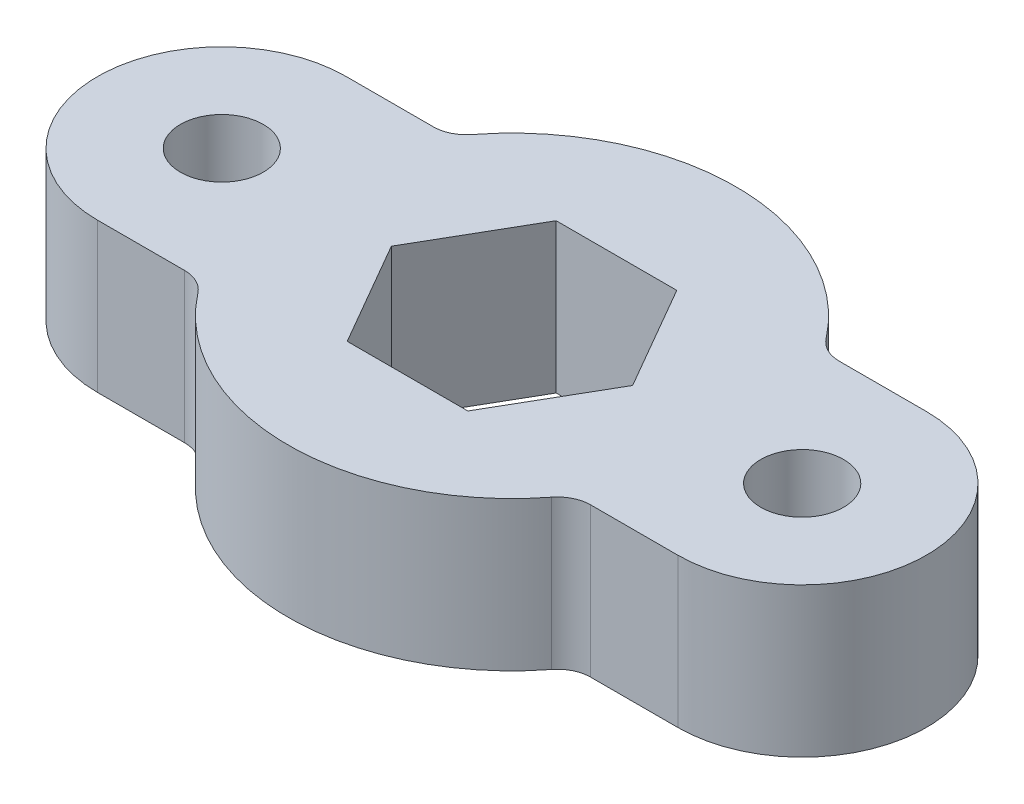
ISO-10303-21;
HEADER;
FILE_DESCRIPTION(('STEP AP214'),'2;1');
FILE_NAME('part.step','',(''),(''),'','','');
FILE_SCHEMA(('AUTOMOTIVE_DESIGN { 1 0 10303 214 1 1 1 1 }'));
ENDSEC;
DATA;
#1=APPLICATION_CONTEXT('core data for automotive mechanical design processes');
#2=APPLICATION_PROTOCOL_DEFINITION('international standard','automotive_design',2000,#1);
#3=PRODUCT_CONTEXT('',#1,'mechanical');
#4=PRODUCT('Part','Part','',(#3));
#5=PRODUCT_RELATED_PRODUCT_CATEGORY('part','',(#4));
#6=PRODUCT_DEFINITION_FORMATION('','',#4);
#7=PRODUCT_DEFINITION_CONTEXT('part definition',#1,'design');
#8=PRODUCT_DEFINITION('design','',#6,#7);
#9=PRODUCT_DEFINITION_SHAPE('','',#8);
#10=(LENGTH_UNIT() NAMED_UNIT(*) SI_UNIT(.MILLI.,.METRE.));
#11=(NAMED_UNIT(*) PLANE_ANGLE_UNIT() SI_UNIT($,.RADIAN.));
#12=(NAMED_UNIT(*) SI_UNIT($,.STERADIAN.) SOLID_ANGLE_UNIT());
#13=UNCERTAINTY_MEASURE_WITH_UNIT(LENGTH_MEASURE(1.E-05),#10,'distance_accuracy_value','');
#14=(GEOMETRIC_REPRESENTATION_CONTEXT(3) GLOBAL_UNCERTAINTY_ASSIGNED_CONTEXT((#13)) GLOBAL_UNIT_ASSIGNED_CONTEXT((#10,
#11,#12)) REPRESENTATION_CONTEXT('',''));
#15=CARTESIAN_POINT('',(0.,0.,0.));
#16=DIRECTION('',(0.,0.,1.));
#17=DIRECTION('',(1.,0.,0.));
#18=AXIS2_PLACEMENT_3D('',#15,#16,#17);
#19=CARTESIAN_POINT('',(-17.5,9.,0.));
#20=DIRECTION('',(0.,1.,0.));
#21=DIRECTION('',(0.,0.,1.));
#22=AXIS2_PLACEMENT_3D('',#19,#20,#21);
#23=PLANE('',#22);
#24=CARTESIAN_POINT('',(-17.5,9.,0.));
#25=DIRECTION('',(0.,1.,0.));
#26=DIRECTION('',(0.,0.,1.));
#27=AXIS2_PLACEMENT_3D('',#24,#25,#26);
#28=CIRCLE('',#27,2.5);
#29=CARTESIAN_POINT('',(-17.5,9.,2.5));
#30=VERTEX_POINT('',#29);
#31=EDGE_CURVE('E195',#30,#30,#28,.T.);
#32=ORIENTED_EDGE('',*,*,#31,.F.);
#33=EDGE_LOOP('',(#32));
#34=FACE_BOUND('',#33,.T.);
#35=CARTESIAN_POINT('',(-17.5,9.,0.));
#36=DIRECTION('',(0.,1.,0.));
#37=DIRECTION('',(0.,0.,1.));
#38=AXIS2_PLACEMENT_3D('',#35,#36,#37);
#39=CIRCLE('',#38,7.5);
#40=CARTESIAN_POINT('',(-17.5,9.,-7.5));
#41=VERTEX_POINT('',#40);
#42=CARTESIAN_POINT('',(-17.5,9.,7.5));
#43=VERTEX_POINT('',#42);
#44=EDGE_CURVE('E216',#41,#43,#39,.T.);
#45=ORIENTED_EDGE('',*,*,#44,.T.);
#46=DIRECTION('',(1.,0.,0.));
#47=VECTOR('',#46,1.);
#48=CARTESIAN_POINT('',(-17.5,9.,7.5));
#49=LINE('',#48,#47);
#50=CARTESIAN_POINT('',(-12.2474487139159,9.,7.5));
#51=VERTEX_POINT('',#50);
#52=EDGE_CURVE('E219',#43,#51,#49,.T.);
#53=ORIENTED_EDGE('',*,*,#52,.T.);
#54=CARTESIAN_POINT('',(-12.2474487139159,9.,9.5));
#55=DIRECTION('',(0.,1.,0.));
#56=DIRECTION('',(0.,0.,1.));
#57=AXIS2_PLACEMENT_3D('',#54,#55,#56);
#58=CIRCLE('',#57,2.);
#59=CARTESIAN_POINT('',(-10.66713275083,9.,8.2741935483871));
#60=VERTEX_POINT('',#59);
#61=EDGE_CURVE('E11',#51,#60,#58,.F.);
#62=ORIENTED_EDGE('',*,*,#61,.T.);
#63=CARTESIAN_POINT('',(0.,9.,0.));
#64=DIRECTION('',(0.,1.,0.));
#65=DIRECTION('',(0.,0.,1.));
#66=AXIS2_PLACEMENT_3D('',#63,#64,#65);
#67=CIRCLE('',#66,13.5);
#68=CARTESIAN_POINT('',(10.66713275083,9.,8.2741935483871));
#69=VERTEX_POINT('',#68);
#70=EDGE_CURVE('E222',#60,#69,#67,.T.);
#71=ORIENTED_EDGE('',*,*,#70,.T.);
#72=CARTESIAN_POINT('',(12.2474487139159,9.,9.5));
#73=DIRECTION('',(0.,1.,0.));
#74=DIRECTION('',(0.,0.,1.));
#75=AXIS2_PLACEMENT_3D('',#72,#73,#74);
#76=CIRCLE('',#75,2.);
#77=CARTESIAN_POINT('',(12.2474487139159,9.,7.5));
#78=VERTEX_POINT('',#77);
#79=EDGE_CURVE('E296',#69,#78,#76,.F.);
#80=ORIENTED_EDGE('',*,*,#79,.T.);
#81=DIRECTION('',(1.,0.,0.));
#82=VECTOR('',#81,1.);
#83=CARTESIAN_POINT('',(17.5,9.,7.49999999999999));
#84=LINE('',#83,#82);
#85=CARTESIAN_POINT('',(17.5,9.,7.49999999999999));
#86=VERTEX_POINT('',#85);
#87=EDGE_CURVE('E225',#78,#86,#84,.T.);
#88=ORIENTED_EDGE('',*,*,#87,.T.);
#89=CARTESIAN_POINT('',(17.5,9.,0.));
#90=DIRECTION('',(0.,1.,0.));
#91=DIRECTION('',(0.,0.,1.));
#92=AXIS2_PLACEMENT_3D('',#89,#90,#91);
#93=CIRCLE('',#92,7.5);
#94=CARTESIAN_POINT('',(17.5,9.,-7.50000000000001));
#95=VERTEX_POINT('',#94);
#96=EDGE_CURVE('E227',#86,#95,#93,.T.);
#97=ORIENTED_EDGE('',*,*,#96,.T.);
#98=DIRECTION('',(-1.,0.,0.));
#99=VECTOR('',#98,1.);
#100=CARTESIAN_POINT('',(17.5,9.,-7.50000000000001));
#101=LINE('',#100,#99);
#102=CARTESIAN_POINT('',(12.2474487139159,9.,-7.5));
#103=VERTEX_POINT('',#102);
#104=EDGE_CURVE('E229',#95,#103,#101,.T.);
#105=ORIENTED_EDGE('',*,*,#104,.T.);
#106=CARTESIAN_POINT('',(12.2474487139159,9.,-9.5));
#107=DIRECTION('',(0.,1.,0.));
#108=DIRECTION('',(0.,0.,1.));
#109=AXIS2_PLACEMENT_3D('',#106,#107,#108);
#110=CIRCLE('',#109,2.);
#111=CARTESIAN_POINT('',(10.66713275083,9.,-8.2741935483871));
#112=VERTEX_POINT('',#111);
#113=EDGE_CURVE('E292',#103,#112,#110,.F.);
#114=ORIENTED_EDGE('',*,*,#113,.T.);
#115=CARTESIAN_POINT('',(0.,9.,0.));
#116=DIRECTION('',(0.,1.,0.));
#117=DIRECTION('',(0.,0.,1.));
#118=AXIS2_PLACEMENT_3D('',#115,#116,#117);
#119=CIRCLE('',#118,13.5);
#120=CARTESIAN_POINT('',(-10.66713275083,9.,-8.2741935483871));
#121=VERTEX_POINT('',#120);
#122=EDGE_CURVE('E232',#112,#121,#119,.T.);
#123=ORIENTED_EDGE('',*,*,#122,.T.);
#124=CARTESIAN_POINT('',(-12.2474487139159,9.,-9.5));
#125=DIRECTION('',(0.,1.,0.));
#126=DIRECTION('',(0.,0.,1.));
#127=AXIS2_PLACEMENT_3D('',#124,#125,#126);
#128=CIRCLE('',#127,2.);
#129=CARTESIAN_POINT('',(-12.2474487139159,9.,-7.5));
#130=VERTEX_POINT('',#129);
#131=EDGE_CURVE('E288',#121,#130,#128,.F.);
#132=ORIENTED_EDGE('',*,*,#131,.T.);
#133=DIRECTION('',(-1.,0.,0.));
#134=VECTOR('',#133,1.);
#135=CARTESIAN_POINT('',(-17.5,9.,-7.5));
#136=LINE('',#135,#134);
#137=EDGE_CURVE('E235',#130,#41,#136,.T.);
#138=ORIENTED_EDGE('',*,*,#137,.T.);
#139=EDGE_LOOP('',(#45,#53,#62,#71,#80,#88,#97,#105,#114,#123,#132,#138));
#140=FACE_BOUND('',#139,.T.);
#141=DIRECTION('',(-1.,0.,0.));
#142=VECTOR('',#141,1.);
#143=CARTESIAN_POINT('',(3.63730669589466,9.,-6.29999999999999));
#144=LINE('',#143,#142);
#145=CARTESIAN_POINT('',(3.63730669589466,9.,-6.29999999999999));
#146=VERTEX_POINT('',#145);
#147=CARTESIAN_POINT('',(-3.63730669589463,9.,-6.29999999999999));
#148=VERTEX_POINT('',#147);
#149=EDGE_CURVE('E167',#146,#148,#144,.T.);
#150=ORIENTED_EDGE('',*,*,#149,.F.);
#151=DIRECTION('',(-0.5,0.,-0.866025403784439));
#152=VECTOR('',#151,1.);
#153=CARTESIAN_POINT('',(7.2746133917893,9.,0.));
#154=LINE('',#153,#152);
#155=CARTESIAN_POINT('',(7.2746133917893,9.,0.));
#156=VERTEX_POINT('',#155);
#157=EDGE_CURVE('E157',#156,#146,#154,.T.);
#158=ORIENTED_EDGE('',*,*,#157,.F.);
#159=DIRECTION('',(0.5,0.,-0.866025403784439));
#160=VECTOR('',#159,1.);
#161=CARTESIAN_POINT('',(3.63730669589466,9.,6.30000000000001));
#162=LINE('',#161,#160);
#163=CARTESIAN_POINT('',(3.63730669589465,9.,6.30000000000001));
#164=VERTEX_POINT('',#163);
#165=EDGE_CURVE('E191',#164,#156,#162,.T.);
#166=ORIENTED_EDGE('',*,*,#165,.F.);
#167=DIRECTION('',(1.,0.,0.));
#168=VECTOR('',#167,1.);
#169=CARTESIAN_POINT('',(-3.63730669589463,9.,6.30000000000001));
#170=LINE('',#169,#168);
#171=CARTESIAN_POINT('',(-3.63730669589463,9.,6.30000000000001));
#172=VERTEX_POINT('',#171);
#173=EDGE_CURVE('E188',#172,#164,#170,.T.);
#174=ORIENTED_EDGE('',*,*,#173,.F.);
#175=DIRECTION('',(0.5,0.,0.866025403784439));
#176=VECTOR('',#175,1.);
#177=CARTESIAN_POINT('',(-7.27461339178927,9.,0.));
#178=LINE('',#177,#176);
#179=CARTESIAN_POINT('',(-7.27461339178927,9.,0.));
#180=VERTEX_POINT('',#179);
#181=EDGE_CURVE('E183',#180,#172,#178,.T.);
#182=ORIENTED_EDGE('',*,*,#181,.F.);
#183=DIRECTION('',(-0.5,0.,0.866025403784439));
#184=VECTOR('',#183,1.);
#185=CARTESIAN_POINT('',(-3.63730669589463,9.,-6.29999999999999));
#186=LINE('',#185,#184);
#187=EDGE_CURVE('E181',#148,#180,#186,.T.);
#188=ORIENTED_EDGE('',*,*,#187,.F.);
#189=EDGE_LOOP('',(#150,#158,#166,#174,#182,#188));
#190=FACE_BOUND('',#189,.T.);
#191=CARTESIAN_POINT('',(17.5,9.,0.));
#192=DIRECTION('',(0.,1.,0.));
#193=DIRECTION('',(0.,0.,1.));
#194=AXIS2_PLACEMENT_3D('',#191,#192,#193);
#195=CIRCLE('',#194,2.5);
#196=CARTESIAN_POINT('',(17.5,9.,2.49999999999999));
#197=VERTEX_POINT('',#196);
#198=EDGE_CURVE('E541',#197,#197,#195,.T.);
#199=ORIENTED_EDGE('',*,*,#198,.F.);
#200=EDGE_LOOP('',(#199));
#201=FACE_BOUND('',#200,.T.);
#202=ADVANCED_FACE('F33',(#34,#140,#190,#201),#23,.T.);
#203=CARTESIAN_POINT('',(-17.5,0.,0.));
#204=DIRECTION('',(0.,1.,0.));
#205=DIRECTION('',(0.,0.,1.));
#206=AXIS2_PLACEMENT_3D('',#203,#204,#205);
#207=PLANE('',#206);
#208=CARTESIAN_POINT('',(-17.5,0.,0.));
#209=DIRECTION('',(0.,1.,0.));
#210=DIRECTION('',(0.,0.,1.));
#211=AXIS2_PLACEMENT_3D('',#208,#209,#210);
#212=CIRCLE('',#211,7.5);
#213=CARTESIAN_POINT('',(-17.5,0.,-7.5));
#214=VERTEX_POINT('',#213);
#215=CARTESIAN_POINT('',(-17.5,0.,7.5));
#216=VERTEX_POINT('',#215);
#217=EDGE_CURVE('E175',#214,#216,#212,.T.);
#218=ORIENTED_EDGE('',*,*,#217,.F.);
#219=DIRECTION('',(-1.,0.,0.));
#220=VECTOR('',#219,1.);
#221=CARTESIAN_POINT('',(-17.5,0.,-7.5));
#222=LINE('',#221,#220);
#223=CARTESIAN_POINT('',(-12.2474487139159,0.,-7.5));
#224=VERTEX_POINT('',#223);
#225=EDGE_CURVE('E220',#224,#214,#222,.T.);
#226=ORIENTED_EDGE('',*,*,#225,.F.);
#227=CARTESIAN_POINT('',(-12.2474487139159,0.,-9.5));
#228=DIRECTION('',(0.,1.,0.));
#229=DIRECTION('',(0.,0.,1.));
#230=AXIS2_PLACEMENT_3D('',#227,#228,#229);
#231=CIRCLE('',#230,2.);
#232=CARTESIAN_POINT('',(-10.66713275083,0.,-8.2741935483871));
#233=VERTEX_POINT('',#232);
#234=EDGE_CURVE('E286',#224,#233,#231,.T.);
#235=ORIENTED_EDGE('',*,*,#234,.T.);
#236=CARTESIAN_POINT('',(0.,0.,0.));
#237=DIRECTION('',(0.,1.,0.));
#238=DIRECTION('',(0.,0.,1.));
#239=AXIS2_PLACEMENT_3D('',#236,#237,#238);
#240=CIRCLE('',#239,13.5);
#241=CARTESIAN_POINT('',(10.66713275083,0.,-8.2741935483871));
#242=VERTEX_POINT('',#241);
#243=EDGE_CURVE('E252',#242,#233,#240,.T.);
#244=ORIENTED_EDGE('',*,*,#243,.F.);
#245=CARTESIAN_POINT('',(12.2474487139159,0.,-9.5));
#246=DIRECTION('',(0.,1.,0.));
#247=DIRECTION('',(0.,0.,1.));
#248=AXIS2_PLACEMENT_3D('',#245,#246,#247);
#249=CIRCLE('',#248,2.);
#250=CARTESIAN_POINT('',(12.2474487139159,0.,-7.5));
#251=VERTEX_POINT('',#250);
#252=EDGE_CURVE('E290',#242,#251,#249,.T.);
#253=ORIENTED_EDGE('',*,*,#252,.T.);
#254=DIRECTION('',(-1.,0.,0.));
#255=VECTOR('',#254,1.);
#256=CARTESIAN_POINT('',(17.5,0.,-7.50000000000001));
#257=LINE('',#256,#255);
#258=CARTESIAN_POINT('',(17.5,0.,-7.50000000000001));
#259=VERTEX_POINT('',#258);
#260=EDGE_CURVE('E249',#259,#251,#257,.T.);
#261=ORIENTED_EDGE('',*,*,#260,.F.);
#262=CARTESIAN_POINT('',(17.5,0.,0.));
#263=DIRECTION('',(0.,1.,0.));
#264=DIRECTION('',(0.,0.,1.));
#265=AXIS2_PLACEMENT_3D('',#262,#263,#264);
#266=CIRCLE('',#265,7.5);
#267=CARTESIAN_POINT('',(17.5,0.,7.49999999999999));
#268=VERTEX_POINT('',#267);
#269=EDGE_CURVE('E247',#268,#259,#266,.T.);
#270=ORIENTED_EDGE('',*,*,#269,.F.);
#271=DIRECTION('',(1.,0.,0.));
#272=VECTOR('',#271,1.);
#273=CARTESIAN_POINT('',(17.5,0.,7.49999999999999));
#274=LINE('',#273,#272);
#275=CARTESIAN_POINT('',(12.2474487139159,0.,7.5));
#276=VERTEX_POINT('',#275);
#277=EDGE_CURVE('E245',#276,#268,#274,.T.);
#278=ORIENTED_EDGE('',*,*,#277,.F.);
#279=CARTESIAN_POINT('',(12.2474487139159,0.,9.5));
#280=DIRECTION('',(0.,1.,0.));
#281=DIRECTION('',(0.,0.,1.));
#282=AXIS2_PLACEMENT_3D('',#279,#280,#281);
#283=CIRCLE('',#282,2.);
#284=CARTESIAN_POINT('',(10.66713275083,0.,8.2741935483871));
#285=VERTEX_POINT('',#284);
#286=EDGE_CURVE('E294',#276,#285,#283,.T.);
#287=ORIENTED_EDGE('',*,*,#286,.T.);
#288=CARTESIAN_POINT('',(0.,0.,0.));
#289=DIRECTION('',(0.,1.,0.));
#290=DIRECTION('',(0.,0.,1.));
#291=AXIS2_PLACEMENT_3D('',#288,#289,#290);
#292=CIRCLE('',#291,13.5);
#293=CARTESIAN_POINT('',(-10.66713275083,0.,8.2741935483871));
#294=VERTEX_POINT('',#293);
#295=EDGE_CURVE('E242',#294,#285,#292,.T.);
#296=ORIENTED_EDGE('',*,*,#295,.F.);
#297=CARTESIAN_POINT('',(-12.2474487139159,0.,9.5));
#298=DIRECTION('',(0.,1.,0.));
#299=DIRECTION('',(0.,0.,1.));
#300=AXIS2_PLACEMENT_3D('',#297,#298,#299);
#301=CIRCLE('',#300,2.);
#302=CARTESIAN_POINT('',(-12.2474487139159,0.,7.5));
#303=VERTEX_POINT('',#302);
#304=EDGE_CURVE('E41',#294,#303,#301,.T.);
#305=ORIENTED_EDGE('',*,*,#304,.T.);
#306=DIRECTION('',(1.,0.,0.));
#307=VECTOR('',#306,1.);
#308=CARTESIAN_POINT('',(-17.5,0.,7.5));
#309=LINE('',#308,#307);
#310=EDGE_CURVE('E240',#216,#303,#309,.T.);
#311=ORIENTED_EDGE('',*,*,#310,.F.);
#312=EDGE_LOOP('',(#218,#226,#235,#244,#253,#261,#270,#278,#287,#296,#305,#311));
#313=FACE_BOUND('',#312,.T.);
#314=DIRECTION('',(-0.5,0.,-0.866025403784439));
#315=VECTOR('',#314,1.);
#316=CARTESIAN_POINT('',(7.2746133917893,0.,0.));
#317=LINE('',#316,#315);
#318=CARTESIAN_POINT('',(7.27461339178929,0.,0.));
#319=VERTEX_POINT('',#318);
#320=CARTESIAN_POINT('',(3.63730669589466,0.,-6.29999999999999));
#321=VERTEX_POINT('',#320);
#322=EDGE_CURVE('E193',#319,#321,#317,.T.);
#323=ORIENTED_EDGE('',*,*,#322,.T.);
#324=DIRECTION('',(-1.,0.,0.));
#325=VECTOR('',#324,1.);
#326=CARTESIAN_POINT('',(3.63730669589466,0.,-6.29999999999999));
#327=LINE('',#326,#325);
#328=CARTESIAN_POINT('',(-3.63730669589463,0.,-6.29999999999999));
#329=VERTEX_POINT('',#328);
#330=EDGE_CURVE('E174',#321,#329,#327,.T.);
#331=ORIENTED_EDGE('',*,*,#330,.T.);
#332=DIRECTION('',(-0.5,0.,0.866025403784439));
#333=VECTOR('',#332,1.);
#334=CARTESIAN_POINT('',(-3.63730669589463,0.,-6.29999999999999));
#335=LINE('',#334,#333);
#336=CARTESIAN_POINT('',(-7.27461339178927,0.,0.));
#337=VERTEX_POINT('',#336);
#338=EDGE_CURVE('E197',#329,#337,#335,.T.);
#339=ORIENTED_EDGE('',*,*,#338,.T.);
#340=DIRECTION('',(0.5,0.,0.866025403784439));
#341=VECTOR('',#340,1.);
#342=CARTESIAN_POINT('',(-7.27461339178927,0.,0.));
#343=LINE('',#342,#341);
#344=CARTESIAN_POINT('',(-3.63730669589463,0.,6.30000000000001));
#345=VERTEX_POINT('',#344);
#346=EDGE_CURVE('E200',#337,#345,#343,.T.);
#347=ORIENTED_EDGE('',*,*,#346,.T.);
#348=DIRECTION('',(1.,0.,0.));
#349=VECTOR('',#348,1.);
#350=CARTESIAN_POINT('',(-3.63730669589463,0.,6.30000000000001));
#351=LINE('',#350,#349);
#352=CARTESIAN_POINT('',(3.63730669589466,0.,6.30000000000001));
#353=VERTEX_POINT('',#352);
#354=EDGE_CURVE('E203',#345,#353,#351,.T.);
#355=ORIENTED_EDGE('',*,*,#354,.T.);
#356=DIRECTION('',(0.5,0.,-0.866025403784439));
#357=VECTOR('',#356,1.);
#358=CARTESIAN_POINT('',(3.63730669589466,0.,6.30000000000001));
#359=LINE('',#358,#357);
#360=EDGE_CURVE('E168',#353,#319,#359,.T.);
#361=ORIENTED_EDGE('',*,*,#360,.T.);
#362=EDGE_LOOP('',(#323,#331,#339,#347,#355,#361));
#363=FACE_BOUND('',#362,.T.);
#364=CARTESIAN_POINT('',(-17.5,0.,0.));
#365=DIRECTION('',(0.,1.,0.));
#366=DIRECTION('',(0.,0.,1.));
#367=AXIS2_PLACEMENT_3D('',#364,#365,#366);
#368=CIRCLE('',#367,2.5);
#369=CARTESIAN_POINT('',(-17.5,0.,2.5));
#370=VERTEX_POINT('',#369);
#371=EDGE_CURVE('E547',#370,#370,#368,.T.);
#372=ORIENTED_EDGE('',*,*,#371,.T.);
#373=EDGE_LOOP('',(#372));
#374=FACE_BOUND('',#373,.T.);
#375=CARTESIAN_POINT('',(17.5,0.,0.));
#376=DIRECTION('',(0.,1.,0.));
#377=DIRECTION('',(0.,0.,1.));
#378=AXIS2_PLACEMENT_3D('',#375,#376,#377);
#379=CIRCLE('',#378,2.5);
#380=CARTESIAN_POINT('',(17.5,0.,2.49999999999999));
#381=VERTEX_POINT('',#380);
#382=EDGE_CURVE('E544',#381,#381,#379,.T.);
#383=ORIENTED_EDGE('',*,*,#382,.T.);
#384=EDGE_LOOP('',(#383));
#385=FACE_BOUND('',#384,.T.);
#386=ADVANCED_FACE('F311',(#313,#363,#374,#385),#207,.F.);
#387=CARTESIAN_POINT('',(-17.5,9.,0.));
#388=DIRECTION('',(0.,-1.,0.));
#389=DIRECTION('',(0.,0.,-1.));
#390=AXIS2_PLACEMENT_3D('',#387,#388,#389);
#391=CYLINDRICAL_SURFACE('',#390,7.5);
#392=ORIENTED_EDGE('',*,*,#217,.T.);
#393=DIRECTION('',(0.,-1.,0.));
#394=VECTOR('',#393,1.);
#395=CARTESIAN_POINT('',(-17.5,9.,7.5));
#396=LINE('',#395,#394);
#397=EDGE_CURVE('E264',#43,#216,#396,.T.);
#398=ORIENTED_EDGE('',*,*,#397,.F.);
#399=ORIENTED_EDGE('',*,*,#44,.F.);
#400=DIRECTION('',(0.,-1.,0.));
#401=VECTOR('',#400,1.);
#402=CARTESIAN_POINT('',(-17.5,9.,-7.5));
#403=LINE('',#402,#401);
#404=EDGE_CURVE('E237',#41,#214,#403,.T.);
#405=ORIENTED_EDGE('',*,*,#404,.T.);
#406=EDGE_LOOP('',(#392,#398,#399,#405));
#407=FACE_BOUND('',#406,.T.);
#408=ADVANCED_FACE('F323',(#407),#391,.T.);
#409=CARTESIAN_POINT('',(-17.5,9.,7.5));
#410=DIRECTION('',(0.,0.,-1.));
#411=DIRECTION('',(-1.,0.,0.));
#412=AXIS2_PLACEMENT_3D('',#409,#410,#411);
#413=PLANE('',#412);
#414=ORIENTED_EDGE('',*,*,#310,.T.);
#415=DIRECTION('',(0.,1.,0.));
#416=VECTOR('',#415,1.);
#417=CARTESIAN_POINT('',(-12.2474487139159,9.,7.5));
#418=LINE('',#417,#416);
#419=EDGE_CURVE('E48',#303,#51,#418,.T.);
#420=ORIENTED_EDGE('',*,*,#419,.T.);
#421=ORIENTED_EDGE('',*,*,#52,.F.);
#422=ORIENTED_EDGE('',*,*,#397,.T.);
#423=EDGE_LOOP('',(#414,#420,#421,#422));
#424=FACE_BOUND('',#423,.T.);
#425=ADVANCED_FACE('F321',(#424),#413,.F.);
#426=CARTESIAN_POINT('',(0.,9.,0.));
#427=DIRECTION('',(0.,-1.,0.));
#428=DIRECTION('',(0.,0.,-1.));
#429=AXIS2_PLACEMENT_3D('',#426,#427,#428);
#430=CYLINDRICAL_SURFACE('',#429,13.5);
#431=ORIENTED_EDGE('',*,*,#295,.T.);
#432=DIRECTION('',(0.,-1.,0.));
#433=VECTOR('',#432,1.);
#434=CARTESIAN_POINT('',(10.66713275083,9.,8.2741935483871));
#435=LINE('',#434,#433);
#436=EDGE_CURVE('E283',#285,#69,#435,.F.);
#437=ORIENTED_EDGE('',*,*,#436,.T.);
#438=ORIENTED_EDGE('',*,*,#70,.F.);
#439=DIRECTION('',(0.,-1.,0.));
#440=VECTOR('',#439,1.);
#441=CARTESIAN_POINT('',(-10.66713275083,9.,8.2741935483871));
#442=LINE('',#441,#440);
#443=EDGE_CURVE('E280',#60,#294,#442,.T.);
#444=ORIENTED_EDGE('',*,*,#443,.T.);
#445=EDGE_LOOP('',(#431,#437,#438,#444));
#446=FACE_BOUND('',#445,.T.);
#447=ADVANCED_FACE('F315',(#446),#430,.T.);
#448=CARTESIAN_POINT('',(17.5,9.,7.49999999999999));
#449=DIRECTION('',(0.,0.,-1.));
#450=DIRECTION('',(-1.,0.,0.));
#451=AXIS2_PLACEMENT_3D('',#448,#449,#450);
#452=PLANE('',#451);
#453=ORIENTED_EDGE('',*,*,#87,.F.);
#454=DIRECTION('',(0.,1.,0.));
#455=VECTOR('',#454,1.);
#456=CARTESIAN_POINT('',(12.2474487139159,0.,7.5));
#457=LINE('',#456,#455);
#458=EDGE_CURVE('E277',#78,#276,#457,.F.);
#459=ORIENTED_EDGE('',*,*,#458,.T.);
#460=ORIENTED_EDGE('',*,*,#277,.T.);
#461=DIRECTION('',(0.,-1.,0.));
#462=VECTOR('',#461,1.);
#463=CARTESIAN_POINT('',(17.5,9.,7.49999999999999));
#464=LINE('',#463,#462);
#465=EDGE_CURVE('E261',#86,#268,#464,.T.);
#466=ORIENTED_EDGE('',*,*,#465,.F.);
#467=EDGE_LOOP('',(#453,#459,#460,#466));
#468=FACE_BOUND('',#467,.T.);
#469=ADVANCED_FACE('F306',(#468),#452,.F.);
#470=CARTESIAN_POINT('',(17.5,9.,0.));
#471=DIRECTION('',(0.,-1.,0.));
#472=DIRECTION('',(0.,0.,-1.));
#473=AXIS2_PLACEMENT_3D('',#470,#471,#472);
#474=CYLINDRICAL_SURFACE('',#473,7.5);
#475=ORIENTED_EDGE('',*,*,#269,.T.);
#476=DIRECTION('',(0.,-1.,0.));
#477=VECTOR('',#476,1.);
#478=CARTESIAN_POINT('',(17.5,9.,-7.50000000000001));
#479=LINE('',#478,#477);
#480=EDGE_CURVE('E258',#95,#259,#479,.T.);
#481=ORIENTED_EDGE('',*,*,#480,.F.);
#482=ORIENTED_EDGE('',*,*,#96,.F.);
#483=ORIENTED_EDGE('',*,*,#465,.T.);
#484=EDGE_LOOP('',(#475,#481,#482,#483));
#485=FACE_BOUND('',#484,.T.);
#486=ADVANCED_FACE('F349',(#485),#474,.T.);
#487=CARTESIAN_POINT('',(17.5,9.,-7.50000000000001));
#488=DIRECTION('',(0.,0.,1.));
#489=DIRECTION('',(1.,0.,0.));
#490=AXIS2_PLACEMENT_3D('',#487,#488,#489);
#491=PLANE('',#490);
#492=ORIENTED_EDGE('',*,*,#260,.T.);
#493=DIRECTION('',(0.,1.,0.));
#494=VECTOR('',#493,1.);
#495=CARTESIAN_POINT('',(12.2474487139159,9.,-7.5));
#496=LINE('',#495,#494);
#497=EDGE_CURVE('E275',#251,#103,#496,.T.);
#498=ORIENTED_EDGE('',*,*,#497,.T.);
#499=ORIENTED_EDGE('',*,*,#104,.F.);
#500=ORIENTED_EDGE('',*,*,#480,.T.);
#501=EDGE_LOOP('',(#492,#498,#499,#500));
#502=FACE_BOUND('',#501,.T.);
#503=ADVANCED_FACE('F346',(#502),#491,.F.);
#504=CARTESIAN_POINT('',(0.,9.,0.));
#505=DIRECTION('',(0.,-1.,0.));
#506=DIRECTION('',(0.,0.,-1.));
#507=AXIS2_PLACEMENT_3D('',#504,#505,#506);
#508=CYLINDRICAL_SURFACE('',#507,13.5);
#509=ORIENTED_EDGE('',*,*,#243,.T.);
#510=DIRECTION('',(0.,-1.,0.));
#511=VECTOR('',#510,1.);
#512=CARTESIAN_POINT('',(-10.66713275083,9.,-8.2741935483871));
#513=LINE('',#512,#511);
#514=EDGE_CURVE('E273',#233,#121,#513,.F.);
#515=ORIENTED_EDGE('',*,*,#514,.T.);
#516=ORIENTED_EDGE('',*,*,#122,.F.);
#517=DIRECTION('',(0.,-1.,0.));
#518=VECTOR('',#517,1.);
#519=CARTESIAN_POINT('',(10.66713275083,9.,-8.2741935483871));
#520=LINE('',#519,#518);
#521=EDGE_CURVE('E270',#112,#242,#520,.T.);
#522=ORIENTED_EDGE('',*,*,#521,.T.);
#523=EDGE_LOOP('',(#509,#515,#516,#522));
#524=FACE_BOUND('',#523,.T.);
#525=ADVANCED_FACE('F337',(#524),#508,.T.);
#526=CARTESIAN_POINT('',(-17.5,9.,-7.5));
#527=DIRECTION('',(0.,0.,1.));
#528=DIRECTION('',(1.,0.,0.));
#529=AXIS2_PLACEMENT_3D('',#526,#527,#528);
#530=PLANE('',#529);
#531=ORIENTED_EDGE('',*,*,#137,.F.);
#532=DIRECTION('',(0.,1.,0.));
#533=VECTOR('',#532,1.);
#534=CARTESIAN_POINT('',(-12.2474487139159,0.,-7.5));
#535=LINE('',#534,#533);
#536=EDGE_CURVE('E267',#130,#224,#535,.F.);
#537=ORIENTED_EDGE('',*,*,#536,.T.);
#538=ORIENTED_EDGE('',*,*,#225,.T.);
#539=ORIENTED_EDGE('',*,*,#404,.F.);
#540=EDGE_LOOP('',(#531,#537,#538,#539));
#541=FACE_BOUND('',#540,.T.);
#542=ADVANCED_FACE('F329',(#541),#530,.F.);
#543=CARTESIAN_POINT('',(7.2746133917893,9.,0.));
#544=DIRECTION('',(-0.866025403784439,0.,0.5));
#545=DIRECTION('',(0.5,0.,0.866025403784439));
#546=AXIS2_PLACEMENT_3D('',#543,#544,#545);
#547=PLANE('',#546);
#548=ORIENTED_EDGE('',*,*,#322,.F.);
#549=DIRECTION('',(0.,-1.,0.));
#550=VECTOR('',#549,1.);
#551=CARTESIAN_POINT('',(7.2746133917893,9.,0.));
#552=LINE('',#551,#550);
#553=EDGE_CURVE('E163',#156,#319,#552,.T.);
#554=ORIENTED_EDGE('',*,*,#553,.F.);
#555=ORIENTED_EDGE('',*,*,#157,.T.);
#556=DIRECTION('',(0.,-1.,0.));
#557=VECTOR('',#556,1.);
#558=CARTESIAN_POINT('',(3.63730669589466,9.,-6.29999999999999));
#559=LINE('',#558,#557);
#560=EDGE_CURVE('E160',#146,#321,#559,.T.);
#561=ORIENTED_EDGE('',*,*,#560,.T.);
#562=EDGE_LOOP('',(#548,#554,#555,#561));
#563=FACE_BOUND('',#562,.T.);
#564=ADVANCED_FACE('F159',(#563),#547,.T.);
#565=CARTESIAN_POINT('',(3.63730669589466,9.,-6.29999999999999));
#566=DIRECTION('',(0.,0.,1.));
#567=DIRECTION('',(1.,0.,0.));
#568=AXIS2_PLACEMENT_3D('',#565,#566,#567);
#569=PLANE('',#568);
#570=ORIENTED_EDGE('',*,*,#330,.F.);
#571=ORIENTED_EDGE('',*,*,#560,.F.);
#572=ORIENTED_EDGE('',*,*,#149,.T.);
#573=DIRECTION('',(0.,-1.,0.));
#574=VECTOR('',#573,1.);
#575=CARTESIAN_POINT('',(-3.63730669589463,9.,-6.29999999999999));
#576=LINE('',#575,#574);
#577=EDGE_CURVE('E176',#148,#329,#576,.T.);
#578=ORIENTED_EDGE('',*,*,#577,.T.);
#579=EDGE_LOOP('',(#570,#571,#572,#578));
#580=FACE_BOUND('',#579,.T.);
#581=ADVANCED_FACE('F171',(#580),#569,.T.);
#582=CARTESIAN_POINT('',(-3.63730669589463,9.,-6.29999999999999));
#583=DIRECTION('',(0.866025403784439,0.,0.5));
#584=DIRECTION('',(0.5,0.,-0.866025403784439));
#585=AXIS2_PLACEMENT_3D('',#582,#583,#584);
#586=PLANE('',#585);
#587=ORIENTED_EDGE('',*,*,#338,.F.);
#588=ORIENTED_EDGE('',*,*,#577,.F.);
#589=ORIENTED_EDGE('',*,*,#187,.T.);
#590=DIRECTION('',(0.,-1.,0.));
#591=VECTOR('',#590,1.);
#592=CARTESIAN_POINT('',(-7.27461339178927,9.,0.));
#593=LINE('',#592,#591);
#594=EDGE_CURVE('E213',#180,#337,#593,.T.);
#595=ORIENTED_EDGE('',*,*,#594,.T.);
#596=EDGE_LOOP('',(#587,#588,#589,#595));
#597=FACE_BOUND('',#596,.T.);
#598=ADVANCED_FACE('F392',(#597),#586,.T.);
#599=CARTESIAN_POINT('',(-7.27461339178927,9.,0.));
#600=DIRECTION('',(0.866025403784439,0.,-0.5));
#601=DIRECTION('',(-0.5,0.,-0.866025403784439));
#602=AXIS2_PLACEMENT_3D('',#599,#600,#601);
#603=PLANE('',#602);
#604=ORIENTED_EDGE('',*,*,#346,.F.);
#605=ORIENTED_EDGE('',*,*,#594,.F.);
#606=ORIENTED_EDGE('',*,*,#181,.T.);
#607=DIRECTION('',(0.,-1.,0.));
#608=VECTOR('',#607,1.);
#609=CARTESIAN_POINT('',(-3.63730669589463,9.,6.30000000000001));
#610=LINE('',#609,#608);
#611=EDGE_CURVE('E211',#172,#345,#610,.T.);
#612=ORIENTED_EDGE('',*,*,#611,.T.);
#613=EDGE_LOOP('',(#604,#605,#606,#612));
#614=FACE_BOUND('',#613,.T.);
#615=ADVANCED_FACE('F398',(#614),#603,.T.);
#616=CARTESIAN_POINT('',(-3.63730669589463,9.,6.30000000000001));
#617=DIRECTION('',(0.,0.,-1.));
#618=DIRECTION('',(-1.,0.,0.));
#619=AXIS2_PLACEMENT_3D('',#616,#617,#618);
#620=PLANE('',#619);
#621=ORIENTED_EDGE('',*,*,#354,.F.);
#622=ORIENTED_EDGE('',*,*,#611,.F.);
#623=ORIENTED_EDGE('',*,*,#173,.T.);
#624=DIRECTION('',(0.,-1.,0.));
#625=VECTOR('',#624,1.);
#626=CARTESIAN_POINT('',(3.63730669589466,9.,6.30000000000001));
#627=LINE('',#626,#625);
#628=EDGE_CURVE('E209',#164,#353,#627,.T.);
#629=ORIENTED_EDGE('',*,*,#628,.T.);
#630=EDGE_LOOP('',(#621,#622,#623,#629));
#631=FACE_BOUND('',#630,.T.);
#632=ADVANCED_FACE('F406',(#631),#620,.T.);
#633=CARTESIAN_POINT('',(3.63730669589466,9.,6.30000000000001));
#634=DIRECTION('',(-0.866025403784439,0.,-0.5));
#635=DIRECTION('',(-0.5,0.,0.866025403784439));
#636=AXIS2_PLACEMENT_3D('',#633,#634,#635);
#637=PLANE('',#636);
#638=ORIENTED_EDGE('',*,*,#360,.F.);
#639=ORIENTED_EDGE('',*,*,#628,.F.);
#640=ORIENTED_EDGE('',*,*,#165,.T.);
#641=ORIENTED_EDGE('',*,*,#553,.T.);
#642=EDGE_LOOP('',(#638,#639,#640,#641));
#643=FACE_BOUND('',#642,.T.);
#644=ADVANCED_FACE('F414',(#643),#637,.T.);
#645=CARTESIAN_POINT('',(-17.5,9.,0.));
#646=DIRECTION('',(0.,-1.,0.));
#647=DIRECTION('',(0.,0.,-1.));
#648=AXIS2_PLACEMENT_3D('',#645,#646,#647);
#649=CYLINDRICAL_SURFACE('',#648,2.5);
#650=ORIENTED_EDGE('',*,*,#31,.T.);
#651=EDGE_LOOP('',(#650));
#652=FACE_BOUND('',#651,.T.);
#653=ORIENTED_EDGE('',*,*,#371,.F.);
#654=EDGE_LOOP('',(#653));
#655=FACE_BOUND('',#654,.T.);
#656=ADVANCED_FACE('F422',(#652,#655),#649,.F.);
#657=CARTESIAN_POINT('',(17.5,9.,0.));
#658=DIRECTION('',(0.,-1.,0.));
#659=DIRECTION('',(0.,0.,-1.));
#660=AXIS2_PLACEMENT_3D('',#657,#658,#659);
#661=CYLINDRICAL_SURFACE('',#660,2.5);
#662=ORIENTED_EDGE('',*,*,#198,.T.);
#663=EDGE_LOOP('',(#662));
#664=FACE_BOUND('',#663,.T.);
#665=ORIENTED_EDGE('',*,*,#382,.F.);
#666=EDGE_LOOP('',(#665));
#667=FACE_BOUND('',#666,.T.);
#668=ADVANCED_FACE('F430',(#664,#667),#661,.F.);
#669=CARTESIAN_POINT('',(-12.2474487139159,9.,-9.5));
#670=DIRECTION('',(0.,-1.,0.));
#671=DIRECTION('',(0.,0.,-1.));
#672=AXIS2_PLACEMENT_3D('',#669,#670,#671);
#673=CYLINDRICAL_SURFACE('',#672,2.);
#674=ORIENTED_EDGE('',*,*,#131,.F.);
#675=ORIENTED_EDGE('',*,*,#514,.F.);
#676=ORIENTED_EDGE('',*,*,#234,.F.);
#677=ORIENTED_EDGE('',*,*,#536,.F.);
#678=EDGE_LOOP('',(#674,#675,#676,#677));
#679=FACE_BOUND('',#678,.T.);
#680=ADVANCED_FACE('F333',(#679),#673,.F.);
#681=CARTESIAN_POINT('',(12.2474487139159,9.,-9.5));
#682=DIRECTION('',(0.,-1.,0.));
#683=DIRECTION('',(0.,0.,-1.));
#684=AXIS2_PLACEMENT_3D('',#681,#682,#683);
#685=CYLINDRICAL_SURFACE('',#684,2.);
#686=ORIENTED_EDGE('',*,*,#113,.F.);
#687=ORIENTED_EDGE('',*,*,#497,.F.);
#688=ORIENTED_EDGE('',*,*,#252,.F.);
#689=ORIENTED_EDGE('',*,*,#521,.F.);
#690=EDGE_LOOP('',(#686,#687,#688,#689));
#691=FACE_BOUND('',#690,.T.);
#692=ADVANCED_FACE('F343',(#691),#685,.F.);
#693=CARTESIAN_POINT('',(12.2474487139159,9.,9.5));
#694=DIRECTION('',(0.,-1.,0.));
#695=DIRECTION('',(0.,0.,-1.));
#696=AXIS2_PLACEMENT_3D('',#693,#694,#695);
#697=CYLINDRICAL_SURFACE('',#696,2.);
#698=ORIENTED_EDGE('',*,*,#79,.F.);
#699=ORIENTED_EDGE('',*,*,#436,.F.);
#700=ORIENTED_EDGE('',*,*,#286,.F.);
#701=ORIENTED_EDGE('',*,*,#458,.F.);
#702=EDGE_LOOP('',(#698,#699,#700,#701));
#703=FACE_BOUND('',#702,.T.);
#704=ADVANCED_FACE('F309',(#703),#697,.F.);
#705=CARTESIAN_POINT('',(-12.2474487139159,9.,9.5));
#706=DIRECTION('',(0.,-1.,0.));
#707=DIRECTION('',(0.,0.,-1.));
#708=AXIS2_PLACEMENT_3D('',#705,#706,#707);
#709=CYLINDRICAL_SURFACE('',#708,2.);
#710=ORIENTED_EDGE('',*,*,#61,.F.);
#711=ORIENTED_EDGE('',*,*,#419,.F.);
#712=ORIENTED_EDGE('',*,*,#304,.F.);
#713=ORIENTED_EDGE('',*,*,#443,.F.);
#714=EDGE_LOOP('',(#710,#711,#712,#713));
#715=FACE_BOUND('',#714,.T.);
#716=ADVANCED_FACE('F35',(#715),#709,.F.);
#717=CLOSED_SHELL('',(#202,#386,#408,#425,#447,#469,#486,#503,#525,#542,#564,#581,#598,#615,
#632,#644,#656,#668,#680,#692,#704,#716));
#718=MANIFOLD_SOLID_BREP('B2',#717);
#719=ADVANCED_BREP_SHAPE_REPRESENTATION('',(#18,#718),#14);
#720=SHAPE_DEFINITION_REPRESENTATION(#9,#719);
ENDSEC;
END-ISO-10303-21;
